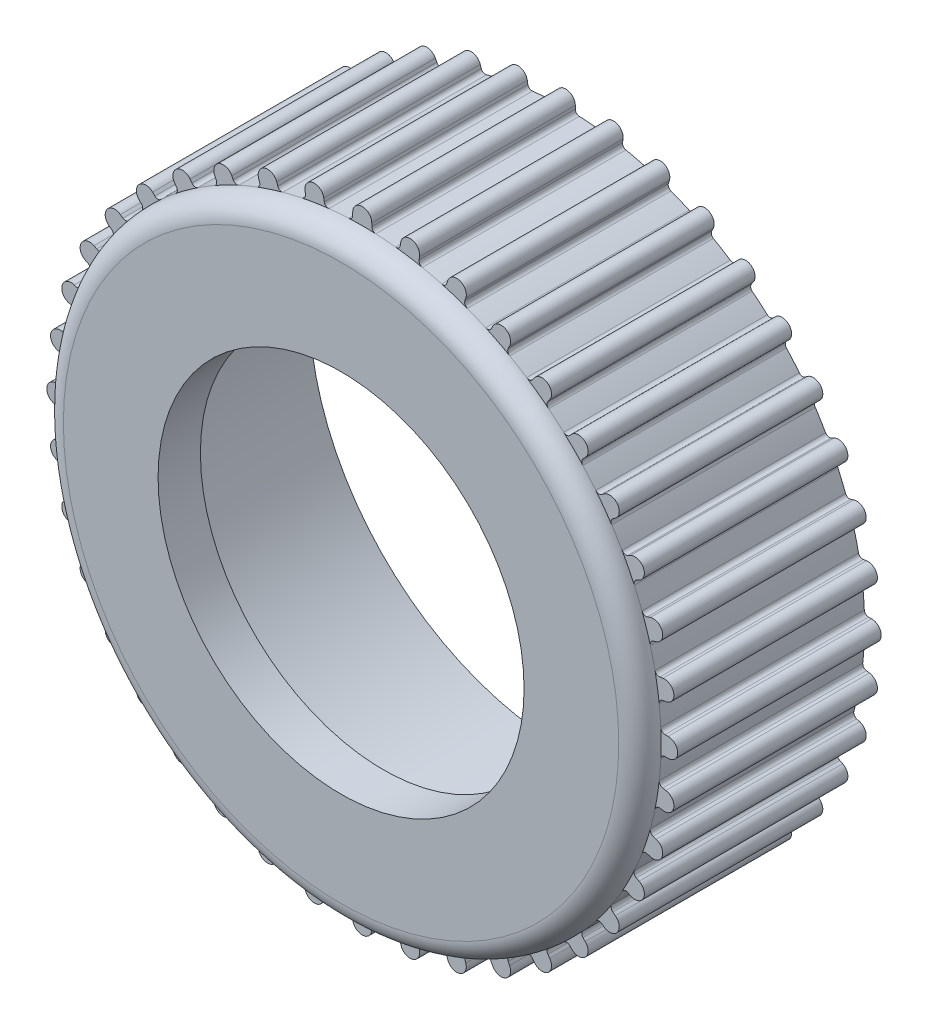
from build123d import *

# Parameters (mm, degrees)
ESQUISSE1_R             = 14.125
EXTRUSION1_DEPTH        = 10.62
COQUE1_T                = -2
ESQUISSE2_R             = 8.65
ENL_V_MAT_EXTRU_1_DEPTH = 22.756278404
CONG_1_R                = 1
EXTRUSION2_START        = -9.62
EXTRUSION2_DEPTH        = 9.62


with BuildPart() as part:
    # Esquisse1 → Extrusion1 (new body)
    with BuildSketch(Plane.XY):
        Circle(ESQUISSE1_R)
    extrude(amount=EXTRUSION1_DEPTH)

    # Coque1
    coque1_openings = [part.faces().sort_by_distance(p)[0] for p in [
        (0, 0, 0),
    ]]
    offset(amount=COQUE1_T, openings=coque1_openings, kind=Kind.INTERSECTION)

    # Esquisse2 → Enl_v. mat.-Extru.1 (cut, through all)
    with BuildSketch(Plane(origin=(0, 0, 8.62), x_dir=(-1, 0, 0), z_dir=(0, 0, -1))):
        Circle(ESQUISSE2_R)
    extrude(amount=-ENL_V_MAT_EXTRU_1_DEPTH, mode=Mode.SUBTRACT)

    # Cong_1
    cong_1_edges = [part.edges().sort_by_distance(p)[0] for p in [
        (-14.125, 0, 10.62),
    ]]
    fillet(cong_1_edges, radius=CONG_1_R)

    # Esquisse3 → Extrusion2 (add)
    with BuildSketch(Plane.XY.offset(9.62).offset(EXTRUSION2_START)):
        with BuildLine():
            Line((-0.45, 14.460245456), (-0.45, 14.310245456))
            ThreePointArc((-0.45, 14.310245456), (-0.505405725, 14.172069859), (-0.640924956, 14.110451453))
            ThreePointArc((-0.640924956, 14.110451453), (0, 14.125), (0.640924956, 14.110451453))
            ThreePointArc((0.640924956, 14.110451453), (0.505405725, 14.172069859), (0.45, 14.310245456))
            Line((0.45, 14.310245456), (0.45, 14.460245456))
            ThreePointArc((0.45, 14.460245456), (0, 14.910245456), (-0.45, 14.460245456))
        make_face()
        with BuildLine():
            Line((1.817621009, 14.352611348), (1.794155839, 14.204458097))
            ThreePointArc((1.794155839, 14.204458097), (1.717816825, 14.076651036), (1.574326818, 14.036991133))
            ThreePointArc((1.574326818, 14.036991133), (2.209636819, 13.951097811), (2.840395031, 13.836465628))
            ThreePointArc((2.840395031, 13.836465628), (2.716183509, 13.918525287), (2.683075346, 14.063667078))
            Line((2.683075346, 14.063667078), (2.706540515, 14.211820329))
            ThreePointArc((2.706540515, 14.211820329), (2.332476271, 14.726675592), (1.817621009, 14.352611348))
        make_face()
        with BuildLine():
            Line((4.040486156, 13.891568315), (3.994133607, 13.748909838))
            ThreePointArc((3.994133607, 13.748909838), (3.898741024, 13.634618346), (3.750813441, 13.617893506))
            ThreePointArc((3.750813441, 13.617893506), (4.364865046, 13.433673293), (4.969925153, 13.221780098))
            ThreePointArc((4.969925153, 13.221780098), (4.86007984, 13.32226043), (4.850084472, 13.470794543))
            Line((4.850084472, 13.470794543), (4.896437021, 13.61345302))
            ThreePointArc((4.896437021, 13.61345302), (4.607519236, 14.1804861), (4.040486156, 13.891568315))
        make_face()
        with BuildLine():
            Line((6.163861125, 13.088468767), (6.09576255, 12.954817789))
            ThreePointArc((6.09576255, 12.954817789), (5.983665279, 12.856856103), (5.834942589, 12.863478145))
            ThreePointArc((5.834942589, 12.863478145), (6.412615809, 12.585467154), (6.977079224, 12.281530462))
            ThreePointArc((6.977079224, 12.281530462), (6.884304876, 12.397957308), (6.897668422, 12.546226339))
            Line((6.897668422, 12.546226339), (6.965766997, 12.679877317))
            ThreePointArc((6.965766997, 12.679877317), (6.769109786, 13.285125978), (6.163861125, 13.088468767))
        make_face()
        with BuildLine():
            Line((8.135461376, 11.96308768), (8.047293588, 11.841735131))
            ThreePointArc((8.047293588, 11.841735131), (7.921251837, 11.762515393), (7.775396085, 11.792321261))
            ThreePointArc((7.775396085, 11.792321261), (8.302466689, 11.427365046), (8.812434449, 11.038868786))
            ThreePointArc((8.812434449, 11.038868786), (8.739015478, 11.168375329), (8.775408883, 11.312728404))
            Line((8.775408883, 11.312728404), (8.863576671, 11.434080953))
            ThreePointArc((8.863576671, 11.434080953), (8.764022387, 12.062641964), (8.135461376, 11.96308768))
        make_face()
        with BuildLine():
            Line((9.906739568, 10.543135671), (9.800673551, 10.437069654))
            ThreePointArc((9.800673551, 10.437069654), (9.663790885, 10.378542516), (9.524393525, 10.430798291))
            ThreePointArc((9.524393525, 10.430798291), (9.987883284, 9.987883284), (10.430798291, 9.524393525))
            ThreePointArc((10.430798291, 9.524393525), (10.378542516, 9.663790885), (10.437069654, 9.800673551))
            Line((10.437069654, 9.800673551), (10.543135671, 9.906739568))
            ThreePointArc((10.543135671, 9.906739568), (10.543135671, 10.543135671), (9.906739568, 10.543135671))
        make_face()
        with BuildLine():
            Line((11.434080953, 8.863576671), (11.312728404, 8.775408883))
            ThreePointArc((11.312728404, 8.775408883), (11.168375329, 8.739015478), (11.038868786, 8.812434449))
            ThreePointArc((11.038868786, 8.812434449), (11.427365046, 8.302466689), (11.792321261, 7.775396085))
            ThreePointArc((11.792321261, 7.775396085), (11.762515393, 7.921251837), (11.841735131, 8.047293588))
            Line((11.841735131, 8.047293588), (11.96308768, 8.135461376))
            ThreePointArc((11.96308768, 8.135461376), (12.062641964, 8.764022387), (11.434080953, 8.863576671))
        make_face()
        with BuildLine():
            Line((12.679877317, 6.965766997), (12.546226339, 6.897668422))
            ThreePointArc((12.546226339, 6.897668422), (12.397957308, 6.884304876), (12.281530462, 6.977079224))
            ThreePointArc((12.281530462, 6.977079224), (12.585467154, 6.412615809), (12.863478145, 5.834942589))
            ThreePointArc((12.863478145, 5.834942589), (12.856856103, 5.983665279), (12.954817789, 6.09576255))
            Line((12.954817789, 6.09576255), (13.088468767, 6.163861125))
            ThreePointArc((13.088468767, 6.163861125), (13.285125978, 6.769109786), (12.679877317, 6.965766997))
        make_face()
        with BuildLine():
            Line((13.61345302, 4.896437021), (13.470794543, 4.850084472))
            ThreePointArc((13.470794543, 4.850084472), (13.32226043, 4.86007984), (13.221780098, 4.969925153))
            ThreePointArc((13.221780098, 4.969925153), (13.433673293, 4.364865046), (13.617893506, 3.750813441))
            ThreePointArc((13.617893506, 3.750813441), (13.634618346, 3.898741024), (13.748909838, 3.994133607))
            Line((13.748909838, 3.994133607), (13.891568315, 4.040486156))
            ThreePointArc((13.891568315, 4.040486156), (14.1804861, 4.607519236), (13.61345302, 4.896437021))
        make_face()
        with BuildLine():
            Line((14.211820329, 2.706540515), (14.063667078, 2.683075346))
            ThreePointArc((14.063667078, 2.683075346), (13.918525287, 2.716183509), (13.836465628, 2.840395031))
            ThreePointArc((13.836465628, 2.840395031), (13.951097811, 2.209636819), (14.036991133, 1.574326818))
            ThreePointArc((14.036991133, 1.574326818), (14.076651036, 1.717816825), (14.204458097, 1.794155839))
            Line((14.204458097, 1.794155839), (14.352611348, 1.817621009))
            ThreePointArc((14.352611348, 1.817621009), (14.726675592, 2.332476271), (14.211820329, 2.706540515))
        make_face()
        with BuildLine():
            Line((14.460245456, 0.45), (14.310245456, 0.45))
            ThreePointArc((14.310245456, 0.45), (14.172069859, 0.505405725), (14.110451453, 0.640924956))
            ThreePointArc((14.110451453, 0.640924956), (14.125, 0), (14.110451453, -0.640924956))
            ThreePointArc((14.110451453, -0.640924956), (14.172069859, -0.505405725), (14.310245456, -0.45))
            Line((14.310245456, -0.45), (14.460245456, -0.45))
            ThreePointArc((14.460245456, -0.45), (14.910245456, 0), (14.460245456, 0.45))
        make_face()
        with BuildLine():
            Line((14.352611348, -1.817621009), (14.204458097, -1.794155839))
            ThreePointArc((14.204458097, -1.794155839), (14.076651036, -1.717816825), (14.036991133, -1.574326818))
            ThreePointArc((14.036991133, -1.574326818), (13.951097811, -2.209636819), (13.836465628, -2.840395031))
            ThreePointArc((13.836465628, -2.840395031), (13.918525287, -2.716183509), (14.063667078, -2.683075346))
            Line((14.063667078, -2.683075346), (14.211820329, -2.706540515))
            ThreePointArc((14.211820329, -2.706540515), (14.726675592, -2.332476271), (14.352611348, -1.817621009))
        make_face()
        with BuildLine():
            Line((13.891568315, -4.040486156), (13.748909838, -3.994133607))
            ThreePointArc((13.748909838, -3.994133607), (13.634618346, -3.898741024), (13.617893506, -3.750813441))
            ThreePointArc((13.617893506, -3.750813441), (13.433673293, -4.364865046), (13.221780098, -4.969925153))
            ThreePointArc((13.221780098, -4.969925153), (13.32226043, -4.86007984), (13.470794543, -4.850084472))
            Line((13.470794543, -4.850084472), (13.61345302, -4.896437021))
            ThreePointArc((13.61345302, -4.896437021), (14.1804861, -4.607519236), (13.891568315, -4.040486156))
        make_face()
        with BuildLine():
            Line((13.088468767, -6.163861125), (12.954817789, -6.09576255))
            ThreePointArc((12.954817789, -6.09576255), (12.856856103, -5.983665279), (12.863478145, -5.834942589))
            ThreePointArc((12.863478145, -5.834942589), (12.585467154, -6.412615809), (12.281530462, -6.977079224))
            ThreePointArc((12.281530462, -6.977079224), (12.397957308, -6.884304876), (12.546226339, -6.897668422))
            Line((12.546226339, -6.897668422), (12.679877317, -6.965766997))
            ThreePointArc((12.679877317, -6.965766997), (13.285125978, -6.769109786), (13.088468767, -6.163861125))
        make_face()
        with BuildLine():
            Line((11.96308768, -8.135461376), (11.841735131, -8.047293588))
            ThreePointArc((11.841735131, -8.047293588), (11.762515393, -7.921251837), (11.792321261, -7.775396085))
            ThreePointArc((11.792321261, -7.775396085), (11.427365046, -8.302466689), (11.038868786, -8.812434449))
            ThreePointArc((11.038868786, -8.812434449), (11.168375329, -8.739015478), (11.312728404, -8.775408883))
            Line((11.312728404, -8.775408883), (11.434080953, -8.863576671))
            ThreePointArc((11.434080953, -8.863576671), (12.062641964, -8.764022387), (11.96308768, -8.135461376))
        make_face()
        with BuildLine():
            Line((10.543135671, -9.906739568), (10.437069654, -9.800673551))
            ThreePointArc((10.437069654, -9.800673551), (10.378542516, -9.663790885), (10.430798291, -9.524393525))
            ThreePointArc((10.430798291, -9.524393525), (9.987883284, -9.987883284), (9.524393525, -10.430798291))
            ThreePointArc((9.524393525, -10.430798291), (9.663790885, -10.378542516), (9.800673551, -10.437069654))
            Line((9.800673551, -10.437069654), (9.906739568, -10.543135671))
            ThreePointArc((9.906739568, -10.543135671), (10.543135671, -10.543135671), (10.543135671, -9.906739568))
        make_face()
        with BuildLine():
            Line((8.863576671, -11.434080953), (8.775408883, -11.312728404))
            ThreePointArc((8.775408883, -11.312728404), (8.739015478, -11.168375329), (8.812434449, -11.038868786))
            ThreePointArc((8.812434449, -11.038868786), (8.302466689, -11.427365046), (7.775396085, -11.792321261))
            ThreePointArc((7.775396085, -11.792321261), (7.921251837, -11.762515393), (8.047293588, -11.841735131))
            Line((8.047293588, -11.841735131), (8.135461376, -11.96308768))
            ThreePointArc((8.135461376, -11.96308768), (8.764022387, -12.062641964), (8.863576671, -11.434080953))
        make_face()
        with BuildLine():
            Line((6.965766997, -12.679877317), (6.897668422, -12.546226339))
            ThreePointArc((6.897668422, -12.546226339), (6.884304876, -12.397957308), (6.977079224, -12.281530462))
            ThreePointArc((6.977079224, -12.281530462), (6.412615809, -12.585467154), (5.834942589, -12.863478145))
            ThreePointArc((5.834942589, -12.863478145), (5.983665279, -12.856856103), (6.09576255, -12.954817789))
            Line((6.09576255, -12.954817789), (6.163861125, -13.088468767))
            ThreePointArc((6.163861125, -13.088468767), (6.769109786, -13.285125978), (6.965766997, -12.679877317))
        make_face()
        with BuildLine():
            Line((4.896437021, -13.61345302), (4.850084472, -13.470794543))
            ThreePointArc((4.850084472, -13.470794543), (4.86007984, -13.32226043), (4.969925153, -13.221780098))
            ThreePointArc((4.969925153, -13.221780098), (4.364865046, -13.433673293), (3.750813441, -13.617893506))
            ThreePointArc((3.750813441, -13.617893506), (3.898741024, -13.634618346), (3.994133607, -13.748909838))
            Line((3.994133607, -13.748909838), (4.040486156, -13.891568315))
            ThreePointArc((4.040486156, -13.891568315), (4.607519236, -14.1804861), (4.896437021, -13.61345302))
        make_face()
        with BuildLine():
            Line((2.706540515, -14.211820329), (2.683075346, -14.063667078))
            ThreePointArc((2.683075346, -14.063667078), (2.716183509, -13.918525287), (2.840395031, -13.836465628))
            ThreePointArc((2.840395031, -13.836465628), (2.209636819, -13.951097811), (1.574326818, -14.036991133))
            ThreePointArc((1.574326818, -14.036991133), (1.717816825, -14.076651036), (1.794155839, -14.204458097))
            Line((1.794155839, -14.204458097), (1.817621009, -14.352611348))
            ThreePointArc((1.817621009, -14.352611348), (2.332476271, -14.726675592), (2.706540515, -14.211820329))
        make_face()
        with BuildLine():
            Line((0.45, -14.460245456), (0.45, -14.310245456))
            ThreePointArc((0.45, -14.310245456), (0.505405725, -14.172069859), (0.640924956, -14.110451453))
            ThreePointArc((0.640924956, -14.110451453), (0, -14.125), (-0.640924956, -14.110451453))
            ThreePointArc((-0.640924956, -14.110451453), (-0.505405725, -14.172069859), (-0.45, -14.310245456))
            Line((-0.45, -14.310245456), (-0.45, -14.460245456))
            ThreePointArc((-0.45, -14.460245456), (0, -14.910245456), (0.45, -14.460245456))
        make_face()
        with BuildLine():
            Line((-1.817621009, -14.352611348), (-1.794155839, -14.204458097))
            ThreePointArc((-1.794155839, -14.204458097), (-1.717816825, -14.076651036), (-1.574326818, -14.036991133))
            ThreePointArc((-1.574326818, -14.036991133), (-2.209636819, -13.951097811), (-2.840395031, -13.836465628))
            ThreePointArc((-2.840395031, -13.836465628), (-2.716183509, -13.918525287), (-2.683075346, -14.063667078))
            Line((-2.683075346, -14.063667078), (-2.706540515, -14.211820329))
            ThreePointArc((-2.706540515, -14.211820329), (-2.332476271, -14.726675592), (-1.817621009, -14.352611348))
        make_face()
        with BuildLine():
            Line((-4.040486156, -13.891568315), (-3.994133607, -13.748909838))
            ThreePointArc((-3.994133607, -13.748909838), (-3.898741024, -13.634618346), (-3.750813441, -13.617893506))
            ThreePointArc((-3.750813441, -13.617893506), (-4.364865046, -13.433673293), (-4.969925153, -13.221780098))
            ThreePointArc((-4.969925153, -13.221780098), (-4.86007984, -13.32226043), (-4.850084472, -13.470794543))
            Line((-4.850084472, -13.470794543), (-4.896437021, -13.61345302))
            ThreePointArc((-4.896437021, -13.61345302), (-4.607519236, -14.1804861), (-4.040486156, -13.891568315))
        make_face()
        with BuildLine():
            Line((-6.163861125, -13.088468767), (-6.09576255, -12.954817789))
            ThreePointArc((-6.09576255, -12.954817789), (-5.983665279, -12.856856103), (-5.834942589, -12.863478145))
            ThreePointArc((-5.834942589, -12.863478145), (-6.412615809, -12.585467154), (-6.977079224, -12.281530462))
            ThreePointArc((-6.977079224, -12.281530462), (-6.884304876, -12.397957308), (-6.897668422, -12.546226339))
            Line((-6.897668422, -12.546226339), (-6.965766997, -12.679877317))
            ThreePointArc((-6.965766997, -12.679877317), (-6.769109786, -13.285125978), (-6.163861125, -13.088468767))
        make_face()
        with BuildLine():
            Line((-8.135461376, -11.96308768), (-8.047293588, -11.841735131))
            ThreePointArc((-8.047293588, -11.841735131), (-7.921251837, -11.762515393), (-7.775396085, -11.792321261))
            ThreePointArc((-7.775396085, -11.792321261), (-8.302466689, -11.427365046), (-8.812434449, -11.038868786))
            ThreePointArc((-8.812434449, -11.038868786), (-8.739015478, -11.168375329), (-8.775408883, -11.312728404))
            Line((-8.775408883, -11.312728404), (-8.863576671, -11.434080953))
            ThreePointArc((-8.863576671, -11.434080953), (-8.764022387, -12.062641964), (-8.135461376, -11.96308768))
        make_face()
        with BuildLine():
            Line((-9.906739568, -10.543135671), (-9.800673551, -10.437069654))
            ThreePointArc((-9.800673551, -10.437069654), (-9.663790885, -10.378542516), (-9.524393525, -10.430798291))
            ThreePointArc((-9.524393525, -10.430798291), (-9.987883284, -9.987883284), (-10.430798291, -9.524393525))
            ThreePointArc((-10.430798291, -9.524393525), (-10.378542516, -9.663790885), (-10.437069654, -9.800673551))
            Line((-10.437069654, -9.800673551), (-10.543135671, -9.906739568))
            ThreePointArc((-10.543135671, -9.906739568), (-10.543135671, -10.543135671), (-9.906739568, -10.543135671))
        make_face()
        with BuildLine():
            Line((-11.434080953, -8.863576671), (-11.312728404, -8.775408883))
            ThreePointArc((-11.312728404, -8.775408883), (-11.168375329, -8.739015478), (-11.038868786, -8.812434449))
            ThreePointArc((-11.038868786, -8.812434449), (-11.427365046, -8.302466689), (-11.792321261, -7.775396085))
            ThreePointArc((-11.792321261, -7.775396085), (-11.762515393, -7.921251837), (-11.841735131, -8.047293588))
            Line((-11.841735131, -8.047293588), (-11.96308768, -8.135461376))
            ThreePointArc((-11.96308768, -8.135461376), (-12.062641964, -8.764022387), (-11.434080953, -8.863576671))
        make_face()
        with BuildLine():
            Line((-12.679877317, -6.965766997), (-12.546226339, -6.897668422))
            ThreePointArc((-12.546226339, -6.897668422), (-12.397957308, -6.884304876), (-12.281530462, -6.977079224))
            ThreePointArc((-12.281530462, -6.977079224), (-12.585467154, -6.412615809), (-12.863478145, -5.834942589))
            ThreePointArc((-12.863478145, -5.834942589), (-12.856856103, -5.983665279), (-12.954817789, -6.09576255))
            Line((-12.954817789, -6.09576255), (-13.088468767, -6.163861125))
            ThreePointArc((-13.088468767, -6.163861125), (-13.285125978, -6.769109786), (-12.679877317, -6.965766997))
        make_face()
        with BuildLine():
            Line((-13.61345302, -4.896437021), (-13.470794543, -4.850084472))
            ThreePointArc((-13.470794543, -4.850084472), (-13.32226043, -4.86007984), (-13.221780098, -4.969925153))
            ThreePointArc((-13.221780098, -4.969925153), (-13.433673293, -4.364865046), (-13.617893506, -3.750813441))
            ThreePointArc((-13.617893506, -3.750813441), (-13.634618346, -3.898741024), (-13.748909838, -3.994133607))
            Line((-13.748909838, -3.994133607), (-13.891568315, -4.040486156))
            ThreePointArc((-13.891568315, -4.040486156), (-14.1804861, -4.607519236), (-13.61345302, -4.896437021))
        make_face()
        with BuildLine():
            Line((-14.211820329, -2.706540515), (-14.063667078, -2.683075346))
            ThreePointArc((-14.063667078, -2.683075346), (-13.918525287, -2.716183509), (-13.836465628, -2.840395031))
            ThreePointArc((-13.836465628, -2.840395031), (-13.951097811, -2.209636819), (-14.036991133, -1.574326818))
            ThreePointArc((-14.036991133, -1.574326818), (-14.076651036, -1.717816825), (-14.204458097, -1.794155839))
            Line((-14.204458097, -1.794155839), (-14.352611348, -1.817621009))
            ThreePointArc((-14.352611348, -1.817621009), (-14.726675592, -2.332476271), (-14.211820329, -2.706540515))
        make_face()
        with BuildLine():
            Line((-14.460245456, -0.45), (-14.310245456, -0.45))
            ThreePointArc((-14.310245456, -0.45), (-14.172069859, -0.505405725), (-14.110451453, -0.640924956))
            ThreePointArc((-14.110451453, -0.640924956), (-14.125, 0), (-14.110451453, 0.640924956))
            ThreePointArc((-14.110451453, 0.640924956), (-14.172069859, 0.505405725), (-14.310245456, 0.45))
            Line((-14.310245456, 0.45), (-14.460245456, 0.45))
            ThreePointArc((-14.460245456, 0.45), (-14.910245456, 0), (-14.460245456, -0.45))
        make_face()
        with BuildLine():
            Line((-14.352611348, 1.817621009), (-14.204458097, 1.794155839))
            ThreePointArc((-14.204458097, 1.794155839), (-14.076651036, 1.717816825), (-14.036991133, 1.574326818))
            ThreePointArc((-14.036991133, 1.574326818), (-13.951097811, 2.209636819), (-13.836465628, 2.840395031))
            ThreePointArc((-13.836465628, 2.840395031), (-13.918525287, 2.716183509), (-14.063667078, 2.683075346))
            Line((-14.063667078, 2.683075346), (-14.211820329, 2.706540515))
            ThreePointArc((-14.211820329, 2.706540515), (-14.726675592, 2.332476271), (-14.352611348, 1.817621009))
        make_face()
        with BuildLine():
            Line((-13.891568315, 4.040486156), (-13.748909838, 3.994133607))
            ThreePointArc((-13.748909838, 3.994133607), (-13.634618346, 3.898741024), (-13.617893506, 3.750813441))
            ThreePointArc((-13.617893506, 3.750813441), (-13.433673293, 4.364865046), (-13.221780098, 4.969925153))
            ThreePointArc((-13.221780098, 4.969925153), (-13.32226043, 4.86007984), (-13.470794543, 4.850084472))
            Line((-13.470794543, 4.850084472), (-13.61345302, 4.896437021))
            ThreePointArc((-13.61345302, 4.896437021), (-14.1804861, 4.607519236), (-13.891568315, 4.040486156))
        make_face()
        with BuildLine():
            Line((-13.088468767, 6.163861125), (-12.954817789, 6.09576255))
            ThreePointArc((-12.954817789, 6.09576255), (-12.856856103, 5.983665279), (-12.863478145, 5.834942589))
            ThreePointArc((-12.863478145, 5.834942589), (-12.585467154, 6.412615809), (-12.281530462, 6.977079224))
            ThreePointArc((-12.281530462, 6.977079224), (-12.397957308, 6.884304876), (-12.546226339, 6.897668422))
            Line((-12.546226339, 6.897668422), (-12.679877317, 6.965766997))
            ThreePointArc((-12.679877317, 6.965766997), (-13.285125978, 6.769109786), (-13.088468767, 6.163861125))
        make_face()
        with BuildLine():
            Line((-11.96308768, 8.135461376), (-11.841735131, 8.047293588))
            ThreePointArc((-11.841735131, 8.047293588), (-11.762515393, 7.921251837), (-11.792321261, 7.775396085))
            ThreePointArc((-11.792321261, 7.775396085), (-11.427365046, 8.302466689), (-11.038868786, 8.812434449))
            ThreePointArc((-11.038868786, 8.812434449), (-11.168375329, 8.739015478), (-11.312728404, 8.775408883))
            Line((-11.312728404, 8.775408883), (-11.434080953, 8.863576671))
            ThreePointArc((-11.434080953, 8.863576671), (-12.062641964, 8.764022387), (-11.96308768, 8.135461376))
        make_face()
        with BuildLine():
            Line((-10.543135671, 9.906739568), (-10.437069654, 9.800673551))
            ThreePointArc((-10.437069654, 9.800673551), (-10.378542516, 9.663790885), (-10.430798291, 9.524393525))
            ThreePointArc((-10.430798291, 9.524393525), (-9.987883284, 9.987883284), (-9.524393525, 10.430798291))
            ThreePointArc((-9.524393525, 10.430798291), (-9.663790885, 10.378542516), (-9.800673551, 10.437069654))
            Line((-9.800673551, 10.437069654), (-9.906739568, 10.543135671))
            ThreePointArc((-9.906739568, 10.543135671), (-10.543135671, 10.543135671), (-10.543135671, 9.906739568))
        make_face()
        with BuildLine():
            Line((-8.863576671, 11.434080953), (-8.775408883, 11.312728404))
            ThreePointArc((-8.775408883, 11.312728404), (-8.739015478, 11.168375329), (-8.812434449, 11.038868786))
            ThreePointArc((-8.812434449, 11.038868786), (-8.302466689, 11.427365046), (-7.775396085, 11.792321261))
            ThreePointArc((-7.775396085, 11.792321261), (-7.921251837, 11.762515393), (-8.047293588, 11.841735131))
            Line((-8.047293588, 11.841735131), (-8.135461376, 11.96308768))
            ThreePointArc((-8.135461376, 11.96308768), (-8.764022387, 12.062641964), (-8.863576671, 11.434080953))
        make_face()
        with BuildLine():
            Line((-6.965766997, 12.679877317), (-6.897668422, 12.546226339))
            ThreePointArc((-6.897668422, 12.546226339), (-6.884304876, 12.397957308), (-6.977079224, 12.281530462))
            ThreePointArc((-6.977079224, 12.281530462), (-6.412615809, 12.585467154), (-5.834942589, 12.863478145))
            ThreePointArc((-5.834942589, 12.863478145), (-5.983665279, 12.856856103), (-6.09576255, 12.954817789))
            Line((-6.09576255, 12.954817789), (-6.163861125, 13.088468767))
            ThreePointArc((-6.163861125, 13.088468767), (-6.769109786, 13.285125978), (-6.965766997, 12.679877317))
        make_face()
        with BuildLine():
            Line((-4.896437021, 13.61345302), (-4.850084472, 13.470794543))
            ThreePointArc((-4.850084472, 13.470794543), (-4.86007984, 13.32226043), (-4.969925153, 13.221780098))
            ThreePointArc((-4.969925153, 13.221780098), (-4.364865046, 13.433673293), (-3.750813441, 13.617893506))
            ThreePointArc((-3.750813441, 13.617893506), (-3.898741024, 13.634618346), (-3.994133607, 13.748909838))
            Line((-3.994133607, 13.748909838), (-4.040486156, 13.891568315))
            ThreePointArc((-4.040486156, 13.891568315), (-4.607519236, 14.1804861), (-4.896437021, 13.61345302))
        make_face()
        with BuildLine():
            Line((-2.706540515, 14.211820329), (-2.683075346, 14.063667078))
            ThreePointArc((-2.683075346, 14.063667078), (-2.716183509, 13.918525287), (-2.840395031, 13.836465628))
            ThreePointArc((-2.840395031, 13.836465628), (-2.209636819, 13.951097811), (-1.574326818, 14.036991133))
            ThreePointArc((-1.574326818, 14.036991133), (-1.717816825, 14.076651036), (-1.794155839, 14.204458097))
            Line((-1.794155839, 14.204458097), (-1.817621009, 14.352611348))
            ThreePointArc((-1.817621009, 14.352611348), (-2.332476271, 14.726675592), (-2.706540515, 14.211820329))
        make_face()
    extrude(amount=EXTRUSION2_DEPTH)


solid = part.part
